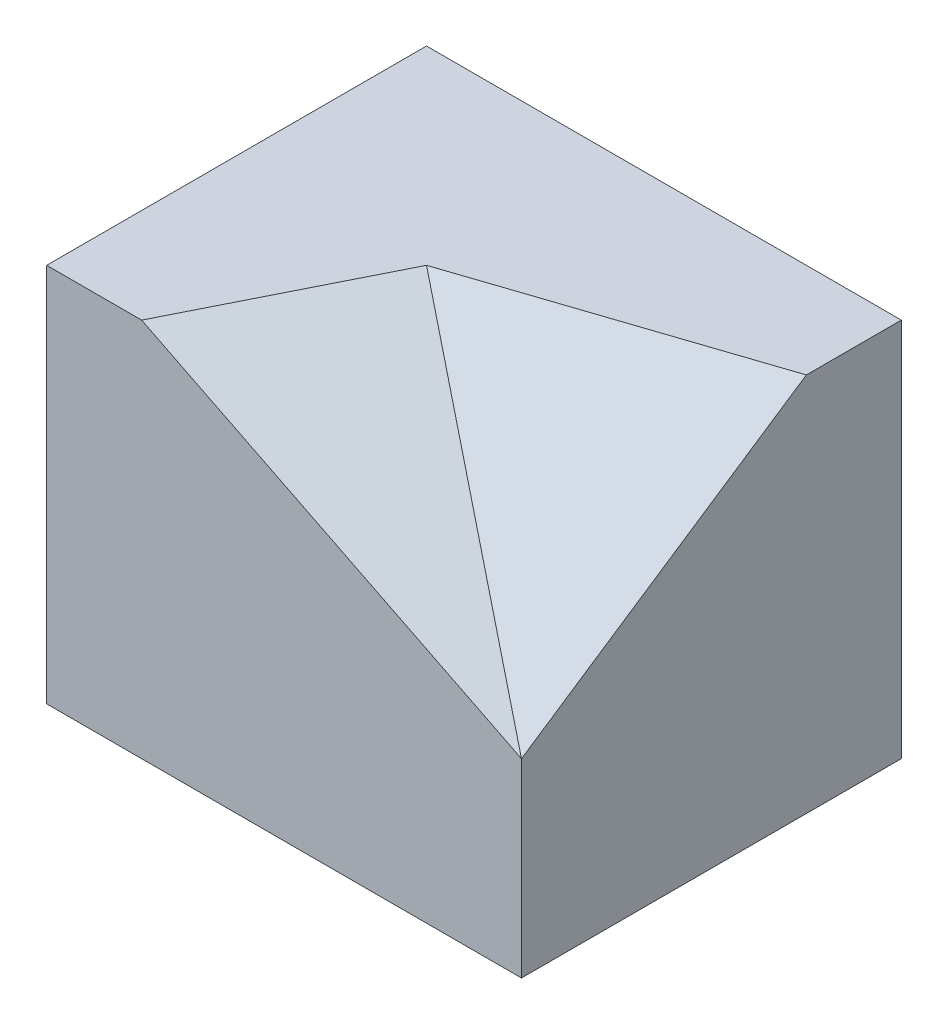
ISO-10303-21;
HEADER;
FILE_DESCRIPTION(('STEP AP214'),'2;1');
FILE_NAME('part.step','',(''),(''),'','','');
FILE_SCHEMA(('AUTOMOTIVE_DESIGN { 1 0 10303 214 1 1 1 1 }'));
ENDSEC;
DATA;
#1=APPLICATION_CONTEXT('core data for automotive mechanical design processes');
#2=APPLICATION_PROTOCOL_DEFINITION('international standard','automotive_design',2000,#1);
#3=PRODUCT_CONTEXT('',#1,'mechanical');
#4=PRODUCT('Part','Part','',(#3));
#5=PRODUCT_RELATED_PRODUCT_CATEGORY('part','',(#4));
#6=PRODUCT_DEFINITION_FORMATION('','',#4);
#7=PRODUCT_DEFINITION_CONTEXT('part definition',#1,'design');
#8=PRODUCT_DEFINITION('design','',#6,#7);
#9=PRODUCT_DEFINITION_SHAPE('','',#8);
#10=(LENGTH_UNIT() NAMED_UNIT(*) SI_UNIT(.MILLI.,.METRE.));
#11=(NAMED_UNIT(*) PLANE_ANGLE_UNIT() SI_UNIT($,.RADIAN.));
#12=(NAMED_UNIT(*) SI_UNIT($,.STERADIAN.) SOLID_ANGLE_UNIT());
#13=UNCERTAINTY_MEASURE_WITH_UNIT(LENGTH_MEASURE(1.E-05),#10,'distance_accuracy_value','');
#14=(GEOMETRIC_REPRESENTATION_CONTEXT(3) GLOBAL_UNCERTAINTY_ASSIGNED_CONTEXT((#13)) GLOBAL_UNIT_ASSIGNED_CONTEXT((#10,
#11,#12)) REPRESENTATION_CONTEXT('',''));
#15=CARTESIAN_POINT('',(0.,0.,0.));
#16=DIRECTION('',(0.,0.,1.));
#17=DIRECTION('',(1.,0.,0.));
#18=AXIS2_PLACEMENT_3D('',#15,#16,#17);
#19=CARTESIAN_POINT('',(-25.,20.,20.));
#20=DIRECTION('',(1.,0.,0.));
#21=DIRECTION('',(0.,0.,-1.));
#22=AXIS2_PLACEMENT_3D('',#19,#20,#21);
#23=PLANE('',#22);
#24=DIRECTION('',(0.,0.,1.));
#25=VECTOR('',#24,1.);
#26=CARTESIAN_POINT('',(-25.,-20.,20.));
#27=LINE('',#26,#25);
#28=CARTESIAN_POINT('',(-25.,-20.,-20.));
#29=VERTEX_POINT('',#28);
#30=CARTESIAN_POINT('',(-25.,-20.,20.));
#31=VERTEX_POINT('',#30);
#32=EDGE_CURVE('E127',#29,#31,#27,.T.);
#33=ORIENTED_EDGE('',*,*,#32,.T.);
#34=DIRECTION('',(0.,-1.,0.));
#35=VECTOR('',#34,1.);
#36=CARTESIAN_POINT('',(-25.,20.,20.));
#37=LINE('',#36,#35);
#38=CARTESIAN_POINT('',(-25.,20.,20.));
#39=VERTEX_POINT('',#38);
#40=EDGE_CURVE('E12',#39,#31,#37,.T.);
#41=ORIENTED_EDGE('',*,*,#40,.F.);
#42=DIRECTION('',(0.,0.,1.));
#43=VECTOR('',#42,1.);
#44=CARTESIAN_POINT('',(-25.,20.,20.));
#45=LINE('',#44,#43);
#46=CARTESIAN_POINT('',(-25.,20.,-20.));
#47=VERTEX_POINT('',#46);
#48=EDGE_CURVE('E112',#47,#39,#45,.T.);
#49=ORIENTED_EDGE('',*,*,#48,.F.);
#50=DIRECTION('',(0.,-1.,0.));
#51=VECTOR('',#50,1.);
#52=CARTESIAN_POINT('',(-25.,20.,-20.));
#53=LINE('',#52,#51);
#54=EDGE_CURVE('E126',#47,#29,#53,.T.);
#55=ORIENTED_EDGE('',*,*,#54,.T.);
#56=EDGE_LOOP('',(#33,#41,#49,#55));
#57=FACE_BOUND('',#56,.T.);
#58=ADVANCED_FACE('F35',(#57),#23,.F.);
#59=CARTESIAN_POINT('',(-25.,20.,20.));
#60=DIRECTION('',(0.,0.,-1.));
#61=DIRECTION('',(-1.,0.,0.));
#62=AXIS2_PLACEMENT_3D('',#59,#60,#61);
#63=PLANE('',#62);
#64=DIRECTION('',(0.,-1.,0.));
#65=VECTOR('',#64,1.);
#66=CARTESIAN_POINT('',(25.,20.,20.));
#67=LINE('',#66,#65);
#68=CARTESIAN_POINT('',(25.,0.,20.));
#69=VERTEX_POINT('',#68);
#70=CARTESIAN_POINT('',(25.,-20.,20.));
#71=VERTEX_POINT('',#70);
#72=EDGE_CURVE('E44',#69,#71,#67,.T.);
#73=ORIENTED_EDGE('',*,*,#72,.F.);
#74=DIRECTION('',(0.894427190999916,-0.447213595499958,0.));
#75=VECTOR('',#74,1.);
#76=CARTESIAN_POINT('',(-15.,20.,20.));
#77=LINE('',#76,#75);
#78=CARTESIAN_POINT('',(-15.,20.,20.));
#79=VERTEX_POINT('',#78);
#80=EDGE_CURVE('E100',#79,#69,#77,.T.);
#81=ORIENTED_EDGE('',*,*,#80,.F.);
#82=DIRECTION('',(1.,0.,0.));
#83=VECTOR('',#82,1.);
#84=CARTESIAN_POINT('',(-25.,20.,20.));
#85=LINE('',#84,#83);
#86=EDGE_CURVE('E87',#39,#79,#85,.T.);
#87=ORIENTED_EDGE('',*,*,#86,.F.);
#88=ORIENTED_EDGE('',*,*,#40,.T.);
#89=DIRECTION('',(1.,0.,0.));
#90=VECTOR('',#89,1.);
#91=CARTESIAN_POINT('',(-25.,-20.,20.));
#92=LINE('',#91,#90);
#93=EDGE_CURVE('E130',#31,#71,#92,.T.);
#94=ORIENTED_EDGE('',*,*,#93,.T.);
#95=EDGE_LOOP('',(#73,#81,#87,#88,#94));
#96=FACE_BOUND('',#95,.T.);
#97=ADVANCED_FACE('F107',(#96),#63,.F.);
#98=CARTESIAN_POINT('',(25.,20.,20.));
#99=DIRECTION('',(-1.,0.,0.));
#100=DIRECTION('',(0.,0.,1.));
#101=AXIS2_PLACEMENT_3D('',#98,#99,#100);
#102=PLANE('',#101);
#103=DIRECTION('',(0.,0.,-1.));
#104=VECTOR('',#103,1.);
#105=CARTESIAN_POINT('',(25.,20.,20.));
#106=LINE('',#105,#104);
#107=CARTESIAN_POINT('',(25.,20.,-10.));
#108=VERTEX_POINT('',#107);
#109=CARTESIAN_POINT('',(25.,20.,-20.));
#110=VERTEX_POINT('',#109);
#111=EDGE_CURVE('E114',#108,#110,#106,.T.);
#112=ORIENTED_EDGE('',*,*,#111,.F.);
#113=DIRECTION('',(0.,-0.554700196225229,0.832050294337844));
#114=VECTOR('',#113,1.);
#115=CARTESIAN_POINT('',(25.,20.,-10.));
#116=LINE('',#115,#114);
#117=EDGE_CURVE('E52',#108,#69,#116,.T.);
#118=ORIENTED_EDGE('',*,*,#117,.T.);
#119=ORIENTED_EDGE('',*,*,#72,.T.);
#120=DIRECTION('',(0.,0.,-1.));
#121=VECTOR('',#120,1.);
#122=CARTESIAN_POINT('',(25.,-20.,20.));
#123=LINE('',#122,#121);
#124=CARTESIAN_POINT('',(25.,-20.,-20.));
#125=VERTEX_POINT('',#124);
#126=EDGE_CURVE('E132',#71,#125,#123,.T.);
#127=ORIENTED_EDGE('',*,*,#126,.T.);
#128=DIRECTION('',(0.,-1.,0.));
#129=VECTOR('',#128,1.);
#130=CARTESIAN_POINT('',(25.,20.,-20.));
#131=LINE('',#130,#129);
#132=EDGE_CURVE('E136',#110,#125,#131,.T.);
#133=ORIENTED_EDGE('',*,*,#132,.F.);
#134=EDGE_LOOP('',(#112,#118,#119,#127,#133));
#135=FACE_BOUND('',#134,.T.);
#136=ADVANCED_FACE('F139',(#135),#102,.F.);
#137=CARTESIAN_POINT('',(-25.,20.,-20.));
#138=DIRECTION('',(0.,0.,1.));
#139=DIRECTION('',(1.,0.,0.));
#140=AXIS2_PLACEMENT_3D('',#137,#138,#139);
#141=PLANE('',#140);
#142=DIRECTION('',(-1.,0.,0.));
#143=VECTOR('',#142,1.);
#144=CARTESIAN_POINT('',(-25.,-20.,-20.));
#145=LINE('',#144,#143);
#146=EDGE_CURVE('E81',#125,#29,#145,.T.);
#147=ORIENTED_EDGE('',*,*,#146,.T.);
#148=ORIENTED_EDGE('',*,*,#54,.F.);
#149=DIRECTION('',(-1.,0.,0.));
#150=VECTOR('',#149,1.);
#151=CARTESIAN_POINT('',(-25.,20.,-20.));
#152=LINE('',#151,#150);
#153=EDGE_CURVE('E61',#110,#47,#152,.T.);
#154=ORIENTED_EDGE('',*,*,#153,.F.);
#155=ORIENTED_EDGE('',*,*,#132,.T.);
#156=EDGE_LOOP('',(#147,#148,#154,#155));
#157=FACE_BOUND('',#156,.T.);
#158=ADVANCED_FACE('F146',(#157),#141,.F.);
#159=CARTESIAN_POINT('',(-25.,20.,-20.));
#160=DIRECTION('',(0.,-1.,0.));
#161=DIRECTION('',(0.,0.,-1.));
#162=AXIS2_PLACEMENT_3D('',#159,#160,#161);
#163=PLANE('',#162);
#164=ORIENTED_EDGE('',*,*,#86,.T.);
#165=DIRECTION('',(-0.447213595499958,0.,0.894427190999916));
#166=VECTOR('',#165,1.);
#167=CARTESIAN_POINT('',(-15.,20.,20.));
#168=LINE('',#167,#166);
#169=CARTESIAN_POINT('',(-4.99999999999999,20.,0.));
#170=VERTEX_POINT('',#169);
#171=EDGE_CURVE('E38',#170,#79,#168,.T.);
#172=ORIENTED_EDGE('',*,*,#171,.F.);
#173=DIRECTION('',(-0.948683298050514,0.,0.316227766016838));
#174=VECTOR('',#173,1.);
#175=CARTESIAN_POINT('',(-4.99999999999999,20.,0.));
#176=LINE('',#175,#174);
#177=EDGE_CURVE('E103',#108,#170,#176,.T.);
#178=ORIENTED_EDGE('',*,*,#177,.F.);
#179=ORIENTED_EDGE('',*,*,#111,.T.);
#180=ORIENTED_EDGE('',*,*,#153,.T.);
#181=ORIENTED_EDGE('',*,*,#48,.T.);
#182=EDGE_LOOP('',(#164,#172,#178,#179,#180,#181));
#183=FACE_BOUND('',#182,.T.);
#184=ADVANCED_FACE('F110',(#183),#163,.F.);
#185=CARTESIAN_POINT('',(-25.,-20.,-20.));
#186=DIRECTION('',(0.,-1.,0.));
#187=DIRECTION('',(0.,0.,-1.));
#188=AXIS2_PLACEMENT_3D('',#185,#186,#187);
#189=PLANE('',#188);
#190=ORIENTED_EDGE('',*,*,#32,.F.);
#191=ORIENTED_EDGE('',*,*,#146,.F.);
#192=ORIENTED_EDGE('',*,*,#126,.F.);
#193=ORIENTED_EDGE('',*,*,#93,.F.);
#194=EDGE_LOOP('',(#190,#191,#192,#193));
#195=FACE_BOUND('',#194,.T.);
#196=ADVANCED_FACE('F144',(#195),#189,.T.);
#197=CARTESIAN_POINT('',(-4.99999999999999,20.,0.));
#198=DIRECTION('',(-0.436435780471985,-0.872871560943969,-0.218217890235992));
#199=DIRECTION('',(0.894427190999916,-0.447213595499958,0.));
#200=AXIS2_PLACEMENT_3D('',#197,#198,#199);
#201=PLANE('',#200);
#202=DIRECTION('',(0.727606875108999,-0.485071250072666,0.485071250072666));
#203=VECTOR('',#202,1.);
#204=CARTESIAN_POINT('',(-4.99999999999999,20.,0.));
#205=LINE('',#204,#203);
#206=EDGE_CURVE('E101',#170,#69,#205,.T.);
#207=ORIENTED_EDGE('',*,*,#206,.F.);
#208=ORIENTED_EDGE('',*,*,#171,.T.);
#209=ORIENTED_EDGE('',*,*,#80,.T.);
#210=EDGE_LOOP('',(#207,#208,#209));
#211=FACE_BOUND('',#210,.T.);
#212=ADVANCED_FACE('F99',(#211),#201,.F.);
#213=CARTESIAN_POINT('',(25.,20.,-10.));
#214=DIRECTION('',(-0.181818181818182,-0.818181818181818,-0.545454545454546));
#215=DIRECTION('',(0.,0.554700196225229,-0.832050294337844));
#216=AXIS2_PLACEMENT_3D('',#213,#214,#215);
#217=PLANE('',#216);
#218=ORIENTED_EDGE('',*,*,#117,.F.);
#219=ORIENTED_EDGE('',*,*,#177,.T.);
#220=ORIENTED_EDGE('',*,*,#206,.T.);
#221=EDGE_LOOP('',(#218,#219,#220));
#222=FACE_BOUND('',#221,.T.);
#223=ADVANCED_FACE('F162',(#222),#217,.F.);
#224=CLOSED_SHELL('',(#58,#97,#136,#158,#184,#196,#212,#223));
#225=MANIFOLD_SOLID_BREP('B2',#224);
#226=ADVANCED_BREP_SHAPE_REPRESENTATION('',(#18,#225),#14);
#227=SHAPE_DEFINITION_REPRESENTATION(#9,#226);
ENDSEC;
END-ISO-10303-21;
